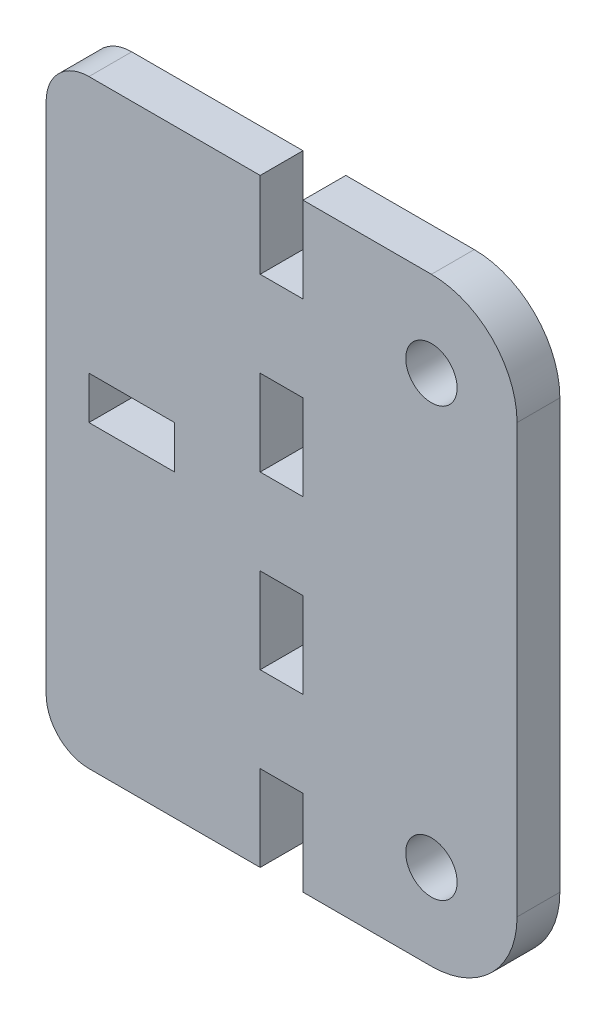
ISO-10303-21;
HEADER;
FILE_DESCRIPTION(('STEP AP214'),'2;1');
FILE_NAME('part.step','',(''),(''),'','','');
FILE_SCHEMA(('AUTOMOTIVE_DESIGN { 1 0 10303 214 1 1 1 1 }'));
ENDSEC;
DATA;
#1=APPLICATION_CONTEXT('core data for automotive mechanical design processes');
#2=APPLICATION_PROTOCOL_DEFINITION('international standard','automotive_design',2000,#1);
#3=PRODUCT_CONTEXT('',#1,'mechanical');
#4=PRODUCT('Part','Part','',(#3));
#5=PRODUCT_RELATED_PRODUCT_CATEGORY('part','',(#4));
#6=PRODUCT_DEFINITION_FORMATION('','',#4);
#7=PRODUCT_DEFINITION_CONTEXT('part definition',#1,'design');
#8=PRODUCT_DEFINITION('design','',#6,#7);
#9=PRODUCT_DEFINITION_SHAPE('','',#8);
#10=(LENGTH_UNIT() NAMED_UNIT(*) SI_UNIT(.MILLI.,.METRE.));
#11=(NAMED_UNIT(*) PLANE_ANGLE_UNIT() SI_UNIT($,.RADIAN.));
#12=(NAMED_UNIT(*) SI_UNIT($,.STERADIAN.) SOLID_ANGLE_UNIT());
#13=UNCERTAINTY_MEASURE_WITH_UNIT(LENGTH_MEASURE(1.E-05),#10,'distance_accuracy_value','');
#14=(GEOMETRIC_REPRESENTATION_CONTEXT(3) GLOBAL_UNCERTAINTY_ASSIGNED_CONTEXT((#13)) GLOBAL_UNIT_ASSIGNED_CONTEXT((#10,
#11,#12)) REPRESENTATION_CONTEXT('',''));
#15=CARTESIAN_POINT('',(0.,0.,0.));
#16=DIRECTION('',(0.,0.,1.));
#17=DIRECTION('',(1.,0.,0.));
#18=AXIS2_PLACEMENT_3D('',#15,#16,#17);
#19=CARTESIAN_POINT('',(0.,35.,5.));
#20=DIRECTION('',(0.,-1.,0.));
#21=DIRECTION('',(1.,0.,0.));
#22=AXIS2_PLACEMENT_3D('',#19,#20,#21);
#23=PLANE('',#22);
#24=DIRECTION('',(-1.,0.,0.));
#25=VECTOR('',#24,1.);
#26=CARTESIAN_POINT('',(0.,35.,0.));
#27=LINE('',#26,#25);
#28=CARTESIAN_POINT('',(-5.,35.,0.));
#29=VERTEX_POINT('',#28);
#30=CARTESIAN_POINT('',(-25.,35.,0.));
#31=VERTEX_POINT('',#30);
#32=EDGE_CURVE('E353',#29,#31,#27,.T.);
#33=ORIENTED_EDGE('',*,*,#32,.T.);
#34=DIRECTION('',(0.,0.,-1.));
#35=VECTOR('',#34,1.);
#36=CARTESIAN_POINT('',(-25.,35.,5.));
#37=LINE('',#36,#35);
#38=CARTESIAN_POINT('',(-25.,35.,5.));
#39=VERTEX_POINT('',#38);
#40=EDGE_CURVE('E56',#31,#39,#37,.F.);
#41=ORIENTED_EDGE('',*,*,#40,.T.);
#42=DIRECTION('',(-1.,0.,0.));
#43=VECTOR('',#42,1.);
#44=CARTESIAN_POINT('',(0.,35.,5.));
#45=LINE('',#44,#43);
#46=CARTESIAN_POINT('',(-5.,35.,5.));
#47=VERTEX_POINT('',#46);
#48=EDGE_CURVE('E360',#47,#39,#45,.T.);
#49=ORIENTED_EDGE('',*,*,#48,.F.);
#50=DIRECTION('',(0.,0.,1.));
#51=VECTOR('',#50,1.);
#52=CARTESIAN_POINT('',(-5.,35.,-5.));
#53=LINE('',#52,#51);
#54=EDGE_CURVE('E279',#29,#47,#53,.T.);
#55=ORIENTED_EDGE('',*,*,#54,.F.);
#56=EDGE_LOOP('',(#33,#41,#49,#55));
#57=FACE_BOUND('',#56,.T.);
#58=ADVANCED_FACE('F33',(#57),#23,.F.);
#59=CARTESIAN_POINT('',(-30.,-35.,5.));
#60=DIRECTION('',(1.,0.,0.));
#61=DIRECTION('',(0.,0.,-1.));
#62=AXIS2_PLACEMENT_3D('',#59,#60,#61);
#63=PLANE('',#62);
#64=DIRECTION('',(0.,-1.,0.));
#65=VECTOR('',#64,1.);
#66=CARTESIAN_POINT('',(-30.,-35.,5.));
#67=LINE('',#66,#65);
#68=CARTESIAN_POINT('',(-30.,30.,5.));
#69=VERTEX_POINT('',#68);
#70=CARTESIAN_POINT('',(-30.,-30.,5.));
#71=VERTEX_POINT('',#70);
#72=EDGE_CURVE('E362',#69,#71,#67,.T.);
#73=ORIENTED_EDGE('',*,*,#72,.F.);
#74=DIRECTION('',(0.,0.,-1.));
#75=VECTOR('',#74,1.);
#76=CARTESIAN_POINT('',(-30.,30.,5.));
#77=LINE('',#76,#75);
#78=CARTESIAN_POINT('',(-30.,30.,0.));
#79=VERTEX_POINT('',#78);
#80=EDGE_CURVE('E421',#69,#79,#77,.T.);
#81=ORIENTED_EDGE('',*,*,#80,.T.);
#82=DIRECTION('',(0.,-1.,0.));
#83=VECTOR('',#82,1.);
#84=CARTESIAN_POINT('',(-30.,-35.,0.));
#85=LINE('',#84,#83);
#86=CARTESIAN_POINT('',(-30.,-30.,0.));
#87=VERTEX_POINT('',#86);
#88=EDGE_CURVE('E369',#79,#87,#85,.T.);
#89=ORIENTED_EDGE('',*,*,#88,.T.);
#90=DIRECTION('',(0.,0.,-1.));
#91=VECTOR('',#90,1.);
#92=CARTESIAN_POINT('',(-30.,-30.,5.));
#93=LINE('',#92,#91);
#94=EDGE_CURVE('E419',#87,#71,#93,.F.);
#95=ORIENTED_EDGE('',*,*,#94,.T.);
#96=EDGE_LOOP('',(#73,#81,#89,#95));
#97=FACE_BOUND('',#96,.T.);
#98=ADVANCED_FACE('F435',(#97),#63,.F.);
#99=CARTESIAN_POINT('',(0.,-35.,5.));
#100=DIRECTION('',(0.,1.,0.));
#101=DIRECTION('',(-1.,0.,0.));
#102=AXIS2_PLACEMENT_3D('',#99,#100,#101);
#103=PLANE('',#102);
#104=DIRECTION('',(1.,0.,0.));
#105=VECTOR('',#104,1.);
#106=CARTESIAN_POINT('',(0.,-35.,5.));
#107=LINE('',#106,#105);
#108=CARTESIAN_POINT('',(-25.,-35.,5.));
#109=VERTEX_POINT('',#108);
#110=CARTESIAN_POINT('',(-5.,-35.,5.));
#111=VERTEX_POINT('',#110);
#112=EDGE_CURVE('E365',#109,#111,#107,.T.);
#113=ORIENTED_EDGE('',*,*,#112,.F.);
#114=DIRECTION('',(0.,0.,-1.));
#115=VECTOR('',#114,1.);
#116=CARTESIAN_POINT('',(-25.,-35.,5.));
#117=LINE('',#116,#115);
#118=CARTESIAN_POINT('',(-25.,-35.,0.));
#119=VERTEX_POINT('',#118);
#120=EDGE_CURVE('E11',#109,#119,#117,.T.);
#121=ORIENTED_EDGE('',*,*,#120,.T.);
#122=DIRECTION('',(1.,0.,0.));
#123=VECTOR('',#122,1.);
#124=CARTESIAN_POINT('',(0.,-35.,0.));
#125=LINE('',#124,#123);
#126=CARTESIAN_POINT('',(-5.,-35.,0.));
#127=VERTEX_POINT('',#126);
#128=EDGE_CURVE('E363',#119,#127,#125,.T.);
#129=ORIENTED_EDGE('',*,*,#128,.T.);
#130=DIRECTION('',(0.,0.,1.));
#131=VECTOR('',#130,1.);
#132=CARTESIAN_POINT('',(-5.,-35.,-5.));
#133=LINE('',#132,#131);
#134=EDGE_CURVE('E321',#127,#111,#133,.T.);
#135=ORIENTED_EDGE('',*,*,#134,.T.);
#136=EDGE_LOOP('',(#113,#121,#129,#135));
#137=FACE_BOUND('',#136,.T.);
#138=ADVANCED_FACE('F494',(#137),#103,.F.);
#139=CARTESIAN_POINT('',(0.,0.,5.));
#140=DIRECTION('',(0.,0.,1.));
#141=DIRECTION('',(1.,0.,0.));
#142=AXIS2_PLACEMENT_3D('',#139,#140,#141);
#143=PLANE('',#142);
#144=CARTESIAN_POINT('',(15.,-25.,5.));
#145=DIRECTION('',(0.,0.,1.));
#146=DIRECTION('',(1.,0.,0.));
#147=AXIS2_PLACEMENT_3D('',#144,#145,#146);
#148=CIRCLE('',#147,3.);
#149=CARTESIAN_POINT('',(18.,-25.,5.));
#150=VERTEX_POINT('',#149);
#151=EDGE_CURVE('E477',#150,#150,#148,.T.);
#152=ORIENTED_EDGE('',*,*,#151,.F.);
#153=EDGE_LOOP('',(#152));
#154=FACE_BOUND('',#153,.T.);
#155=CARTESIAN_POINT('',(15.,25.,5.));
#156=DIRECTION('',(0.,0.,1.));
#157=DIRECTION('',(1.,0.,0.));
#158=AXIS2_PLACEMENT_3D('',#155,#156,#157);
#159=CIRCLE('',#158,3.);
#160=CARTESIAN_POINT('',(18.,25.,5.));
#161=VERTEX_POINT('',#160);
#162=EDGE_CURVE('E471',#161,#161,#159,.T.);
#163=ORIENTED_EDGE('',*,*,#162,.F.);
#164=EDGE_LOOP('',(#163));
#165=FACE_BOUND('',#164,.T.);
#166=DIRECTION('',(0.,-1.,0.));
#167=VECTOR('',#166,1.);
#168=CARTESIAN_POINT('',(0.,35.,5.));
#169=LINE('',#168,#167);
#170=CARTESIAN_POINT('',(0.,-5.,5.));
#171=VERTEX_POINT('',#170);
#172=CARTESIAN_POINT('',(0.,-15.,5.));
#173=VERTEX_POINT('',#172);
#174=EDGE_CURVE('E244',#171,#173,#169,.T.);
#175=ORIENTED_EDGE('',*,*,#174,.T.);
#176=DIRECTION('',(1.,0.,0.));
#177=VECTOR('',#176,1.);
#178=CARTESIAN_POINT('',(0.,-15.,5.));
#179=LINE('',#178,#177);
#180=CARTESIAN_POINT('',(-5.,-15.,5.));
#181=VERTEX_POINT('',#180);
#182=EDGE_CURVE('E293',#181,#173,#179,.T.);
#183=ORIENTED_EDGE('',*,*,#182,.F.);
#184=DIRECTION('',(0.,-1.,0.));
#185=VECTOR('',#184,1.);
#186=CARTESIAN_POINT('',(-5.,-15.,5.));
#187=LINE('',#186,#185);
#188=CARTESIAN_POINT('',(-5.,-5.,5.));
#189=VERTEX_POINT('',#188);
#190=EDGE_CURVE('E304',#189,#181,#187,.T.);
#191=ORIENTED_EDGE('',*,*,#190,.F.);
#192=DIRECTION('',(-1.,0.,0.));
#193=VECTOR('',#192,1.);
#194=CARTESIAN_POINT('',(0.,-5.,5.));
#195=LINE('',#194,#193);
#196=EDGE_CURVE('E301',#171,#189,#195,.T.);
#197=ORIENTED_EDGE('',*,*,#196,.F.);
#198=EDGE_LOOP('',(#175,#183,#191,#197));
#199=FACE_BOUND('',#198,.T.);
#200=CARTESIAN_POINT('',(0.,15.,5.));
#201=VERTEX_POINT('',#200);
#202=CARTESIAN_POINT('',(0.,5.,5.));
#203=VERTEX_POINT('',#202);
#204=EDGE_CURVE('E257',#201,#203,#169,.T.);
#205=ORIENTED_EDGE('',*,*,#204,.T.);
#206=DIRECTION('',(1.,0.,0.));
#207=VECTOR('',#206,1.);
#208=CARTESIAN_POINT('',(0.,5.,5.));
#209=LINE('',#208,#207);
#210=CARTESIAN_POINT('',(-5.,5.,5.));
#211=VERTEX_POINT('',#210);
#212=EDGE_CURVE('E278',#211,#203,#209,.T.);
#213=ORIENTED_EDGE('',*,*,#212,.F.);
#214=DIRECTION('',(0.,-1.,0.));
#215=VECTOR('',#214,1.);
#216=CARTESIAN_POINT('',(-5.,5.,5.));
#217=LINE('',#216,#215);
#218=CARTESIAN_POINT('',(-5.,15.,5.));
#219=VERTEX_POINT('',#218);
#220=EDGE_CURVE('E287',#219,#211,#217,.T.);
#221=ORIENTED_EDGE('',*,*,#220,.F.);
#222=DIRECTION('',(-1.,0.,0.));
#223=VECTOR('',#222,1.);
#224=CARTESIAN_POINT('',(0.,15.,5.));
#225=LINE('',#224,#223);
#226=EDGE_CURVE('E284',#201,#219,#225,.T.);
#227=ORIENTED_EDGE('',*,*,#226,.F.);
#228=EDGE_LOOP('',(#205,#213,#221,#227));
#229=FACE_BOUND('',#228,.T.);
#230=ORIENTED_EDGE('',*,*,#48,.T.);
#231=CARTESIAN_POINT('',(-25.,30.,5.));
#232=DIRECTION('',(0.,0.,1.));
#233=DIRECTION('',(1.,0.,0.));
#234=AXIS2_PLACEMENT_3D('',#231,#232,#233);
#235=CIRCLE('',#234,5.);
#236=EDGE_CURVE('E41',#39,#69,#235,.T.);
#237=ORIENTED_EDGE('',*,*,#236,.T.);
#238=ORIENTED_EDGE('',*,*,#72,.T.);
#239=CARTESIAN_POINT('',(-25.,-30.,5.));
#240=DIRECTION('',(0.,0.,1.));
#241=DIRECTION('',(1.,0.,0.));
#242=AXIS2_PLACEMENT_3D('',#239,#240,#241);
#243=CIRCLE('',#242,5.);
#244=EDGE_CURVE('E48',#71,#109,#243,.T.);
#245=ORIENTED_EDGE('',*,*,#244,.T.);
#246=ORIENTED_EDGE('',*,*,#112,.T.);
#247=DIRECTION('',(0.,-1.,0.));
#248=VECTOR('',#247,1.);
#249=CARTESIAN_POINT('',(-5.,-35.,5.));
#250=LINE('',#249,#248);
#251=CARTESIAN_POINT('',(-5.,-25.,5.));
#252=VERTEX_POINT('',#251);
#253=EDGE_CURVE('E317',#252,#111,#250,.T.);
#254=ORIENTED_EDGE('',*,*,#253,.F.);
#255=DIRECTION('',(-1.,0.,0.));
#256=VECTOR('',#255,1.);
#257=CARTESIAN_POINT('',(0.,-25.,5.));
#258=LINE('',#257,#256);
#259=CARTESIAN_POINT('',(0.,-25.,5.));
#260=VERTEX_POINT('',#259);
#261=EDGE_CURVE('E241',#260,#252,#258,.T.);
#262=ORIENTED_EDGE('',*,*,#261,.F.);
#263=CARTESIAN_POINT('',(0.,-35.,5.));
#264=VERTEX_POINT('',#263);
#265=EDGE_CURVE('E236',#260,#264,#169,.T.);
#266=ORIENTED_EDGE('',*,*,#265,.T.);
#267=DIRECTION('',(-1.,0.,0.));
#268=VECTOR('',#267,1.);
#269=CARTESIAN_POINT('',(25.,-35.,5.));
#270=LINE('',#269,#268);
#271=CARTESIAN_POINT('',(15.,-35.,5.));
#272=VERTEX_POINT('',#271);
#273=EDGE_CURVE('E221',#272,#264,#270,.T.);
#274=ORIENTED_EDGE('',*,*,#273,.F.);
#275=CARTESIAN_POINT('',(15.,-25.,5.));
#276=DIRECTION('',(0.,0.,1.));
#277=DIRECTION('',(1.,0.,0.));
#278=AXIS2_PLACEMENT_3D('',#275,#276,#277);
#279=CIRCLE('',#278,10.);
#280=CARTESIAN_POINT('',(25.,-25.,5.));
#281=VERTEX_POINT('',#280);
#282=EDGE_CURVE('E408',#272,#281,#279,.T.);
#283=ORIENTED_EDGE('',*,*,#282,.T.);
#284=DIRECTION('',(0.,-1.,0.));
#285=VECTOR('',#284,1.);
#286=CARTESIAN_POINT('',(25.,35.,5.));
#287=LINE('',#286,#285);
#288=CARTESIAN_POINT('',(25.,25.,5.));
#289=VERTEX_POINT('',#288);
#290=EDGE_CURVE('E264',#289,#281,#287,.T.);
#291=ORIENTED_EDGE('',*,*,#290,.F.);
#292=CARTESIAN_POINT('',(15.,25.,5.));
#293=DIRECTION('',(0.,0.,1.));
#294=DIRECTION('',(1.,0.,0.));
#295=AXIS2_PLACEMENT_3D('',#292,#293,#294);
#296=CIRCLE('',#295,10.);
#297=CARTESIAN_POINT('',(15.,35.,5.));
#298=VERTEX_POINT('',#297);
#299=EDGE_CURVE('E410',#289,#298,#296,.T.);
#300=ORIENTED_EDGE('',*,*,#299,.T.);
#301=DIRECTION('',(-1.,0.,0.));
#302=VECTOR('',#301,1.);
#303=CARTESIAN_POINT('',(25.,35.,5.));
#304=LINE('',#303,#302);
#305=CARTESIAN_POINT('',(0.,35.,5.));
#306=VERTEX_POINT('',#305);
#307=EDGE_CURVE('E265',#298,#306,#304,.T.);
#308=ORIENTED_EDGE('',*,*,#307,.T.);
#309=CARTESIAN_POINT('',(0.,25.,5.));
#310=VERTEX_POINT('',#309);
#311=EDGE_CURVE('E247',#306,#310,#169,.T.);
#312=ORIENTED_EDGE('',*,*,#311,.T.);
#313=DIRECTION('',(1.,0.,0.));
#314=VECTOR('',#313,1.);
#315=CARTESIAN_POINT('',(0.,25.,5.));
#316=LINE('',#315,#314);
#317=CARTESIAN_POINT('',(-5.,25.,5.));
#318=VERTEX_POINT('',#317);
#319=EDGE_CURVE('E231',#318,#310,#316,.T.);
#320=ORIENTED_EDGE('',*,*,#319,.F.);
#321=DIRECTION('',(0.,-1.,0.));
#322=VECTOR('',#321,1.);
#323=CARTESIAN_POINT('',(-5.,25.,5.));
#324=LINE('',#323,#322);
#325=EDGE_CURVE('E272',#47,#318,#324,.T.);
#326=ORIENTED_EDGE('',*,*,#325,.F.);
#327=EDGE_LOOP('',(#230,#237,#238,#245,#246,#254,#262,#266,#274,#283,#291,#300,#308,#312,#320,#326));
#328=FACE_BOUND('',#327,.T.);
#329=DIRECTION('',(0.,1.,0.));
#330=VECTOR('',#329,1.);
#331=CARTESIAN_POINT('',(-15.,0.,5.));
#332=LINE('',#331,#330);
#333=CARTESIAN_POINT('',(-15.,0.,5.));
#334=VERTEX_POINT('',#333);
#335=CARTESIAN_POINT('',(-15.,5.,5.));
#336=VERTEX_POINT('',#335);
#337=EDGE_CURVE('E324',#334,#336,#332,.T.);
#338=ORIENTED_EDGE('',*,*,#337,.F.);
#339=DIRECTION('',(1.,0.,0.));
#340=VECTOR('',#339,1.);
#341=CARTESIAN_POINT('',(-15.,0.,5.));
#342=LINE('',#341,#340);
#343=CARTESIAN_POINT('',(-25.,0.,5.));
#344=VERTEX_POINT('',#343);
#345=EDGE_CURVE('E332',#344,#334,#342,.T.);
#346=ORIENTED_EDGE('',*,*,#345,.F.);
#347=DIRECTION('',(0.,-1.,0.));
#348=VECTOR('',#347,1.);
#349=CARTESIAN_POINT('',(-25.,0.,5.));
#350=LINE('',#349,#348);
#351=CARTESIAN_POINT('',(-25.,5.,5.));
#352=VERTEX_POINT('',#351);
#353=EDGE_CURVE('E346',#352,#344,#350,.T.);
#354=ORIENTED_EDGE('',*,*,#353,.F.);
#355=DIRECTION('',(-1.,0.,0.));
#356=VECTOR('',#355,1.);
#357=CARTESIAN_POINT('',(-15.,5.,5.));
#358=LINE('',#357,#356);
#359=EDGE_CURVE('E343',#336,#352,#358,.T.);
#360=ORIENTED_EDGE('',*,*,#359,.F.);
#361=EDGE_LOOP('',(#338,#346,#354,#360));
#362=FACE_BOUND('',#361,.T.);
#363=ADVANCED_FACE('F237',(#154,#165,#199,#229,#328,#362),#143,.T.);
#364=CARTESIAN_POINT('',(0.,0.,0.));
#365=DIRECTION('',(0.,0.,1.));
#366=DIRECTION('',(1.,0.,0.));
#367=AXIS2_PLACEMENT_3D('',#364,#365,#366);
#368=PLANE('',#367);
#369=CARTESIAN_POINT('',(15.,-25.,0.));
#370=DIRECTION('',(0.,0.,1.));
#371=DIRECTION('',(1.,0.,0.));
#372=AXIS2_PLACEMENT_3D('',#369,#370,#371);
#373=CIRCLE('',#372,3.);
#374=CARTESIAN_POINT('',(18.,-25.,0.));
#375=VERTEX_POINT('',#374);
#376=EDGE_CURVE('E474',#375,#375,#373,.T.);
#377=ORIENTED_EDGE('',*,*,#376,.T.);
#378=EDGE_LOOP('',(#377));
#379=FACE_BOUND('',#378,.T.);
#380=CARTESIAN_POINT('',(15.,25.,0.));
#381=DIRECTION('',(0.,0.,1.));
#382=DIRECTION('',(1.,0.,0.));
#383=AXIS2_PLACEMENT_3D('',#380,#381,#382);
#384=CIRCLE('',#383,3.);
#385=CARTESIAN_POINT('',(18.,25.,0.));
#386=VERTEX_POINT('',#385);
#387=EDGE_CURVE('E245',#386,#386,#384,.T.);
#388=ORIENTED_EDGE('',*,*,#387,.T.);
#389=EDGE_LOOP('',(#388));
#390=FACE_BOUND('',#389,.T.);
#391=DIRECTION('',(1.,0.,0.));
#392=VECTOR('',#391,1.);
#393=CARTESIAN_POINT('',(0.,-15.,0.));
#394=LINE('',#393,#392);
#395=CARTESIAN_POINT('',(-5.,-15.,0.));
#396=VERTEX_POINT('',#395);
#397=CARTESIAN_POINT('',(0.,-15.,0.));
#398=VERTEX_POINT('',#397);
#399=EDGE_CURVE('E384',#396,#398,#394,.T.);
#400=ORIENTED_EDGE('',*,*,#399,.T.);
#401=DIRECTION('',(0.,1.,0.));
#402=VECTOR('',#401,1.);
#403=CARTESIAN_POINT('',(0.,35.,0.));
#404=LINE('',#403,#402);
#405=CARTESIAN_POINT('',(0.,-5.,0.));
#406=VERTEX_POINT('',#405);
#407=EDGE_CURVE('E261',#398,#406,#404,.T.);
#408=ORIENTED_EDGE('',*,*,#407,.T.);
#409=DIRECTION('',(-1.,0.,0.));
#410=VECTOR('',#409,1.);
#411=CARTESIAN_POINT('',(0.,-5.,0.));
#412=LINE('',#411,#410);
#413=CARTESIAN_POINT('',(-5.,-5.,0.));
#414=VERTEX_POINT('',#413);
#415=EDGE_CURVE('E378',#406,#414,#412,.T.);
#416=ORIENTED_EDGE('',*,*,#415,.T.);
#417=DIRECTION('',(0.,-1.,0.));
#418=VECTOR('',#417,1.);
#419=CARTESIAN_POINT('',(-5.,0.,0.));
#420=LINE('',#419,#418);
#421=EDGE_CURVE('E381',#414,#396,#420,.T.);
#422=ORIENTED_EDGE('',*,*,#421,.T.);
#423=EDGE_LOOP('',(#400,#408,#416,#422));
#424=FACE_BOUND('',#423,.T.);
#425=DIRECTION('',(1.,0.,0.));
#426=VECTOR('',#425,1.);
#427=CARTESIAN_POINT('',(0.,5.,0.));
#428=LINE('',#427,#426);
#429=CARTESIAN_POINT('',(-5.,5.,0.));
#430=VERTEX_POINT('',#429);
#431=CARTESIAN_POINT('',(0.,5.,0.));
#432=VERTEX_POINT('',#431);
#433=EDGE_CURVE('E393',#430,#432,#428,.T.);
#434=ORIENTED_EDGE('',*,*,#433,.T.);
#435=CARTESIAN_POINT('',(0.,15.,0.));
#436=VERTEX_POINT('',#435);
#437=EDGE_CURVE('E254',#432,#436,#404,.T.);
#438=ORIENTED_EDGE('',*,*,#437,.T.);
#439=DIRECTION('',(-1.,0.,0.));
#440=VECTOR('',#439,1.);
#441=CARTESIAN_POINT('',(0.,15.,0.));
#442=LINE('',#441,#440);
#443=CARTESIAN_POINT('',(-5.,15.,0.));
#444=VERTEX_POINT('',#443);
#445=EDGE_CURVE('E387',#436,#444,#442,.T.);
#446=ORIENTED_EDGE('',*,*,#445,.T.);
#447=DIRECTION('',(0.,-1.,0.));
#448=VECTOR('',#447,1.);
#449=CARTESIAN_POINT('',(-5.,0.,0.));
#450=LINE('',#449,#448);
#451=EDGE_CURVE('E390',#444,#430,#450,.T.);
#452=ORIENTED_EDGE('',*,*,#451,.T.);
#453=EDGE_LOOP('',(#434,#438,#446,#452));
#454=FACE_BOUND('',#453,.T.);
#455=DIRECTION('',(1.,0.,0.));
#456=VECTOR('',#455,1.);
#457=CARTESIAN_POINT('',(-15.,0.,0.));
#458=LINE('',#457,#456);
#459=CARTESIAN_POINT('',(-25.,0.,0.));
#460=VERTEX_POINT('',#459);
#461=CARTESIAN_POINT('',(-15.,0.,0.));
#462=VERTEX_POINT('',#461);
#463=EDGE_CURVE('E338',#460,#462,#458,.T.);
#464=ORIENTED_EDGE('',*,*,#463,.T.);
#465=DIRECTION('',(0.,1.,0.));
#466=VECTOR('',#465,1.);
#467=CARTESIAN_POINT('',(-15.,0.,0.));
#468=LINE('',#467,#466);
#469=CARTESIAN_POINT('',(-15.,5.,0.));
#470=VERTEX_POINT('',#469);
#471=EDGE_CURVE('E328',#462,#470,#468,.T.);
#472=ORIENTED_EDGE('',*,*,#471,.T.);
#473=DIRECTION('',(-1.,0.,0.));
#474=VECTOR('',#473,1.);
#475=CARTESIAN_POINT('',(-15.,5.,0.));
#476=LINE('',#475,#474);
#477=CARTESIAN_POINT('',(-25.,5.,0.));
#478=VERTEX_POINT('',#477);
#479=EDGE_CURVE('E331',#470,#478,#476,.T.);
#480=ORIENTED_EDGE('',*,*,#479,.T.);
#481=DIRECTION('',(0.,-1.,0.));
#482=VECTOR('',#481,1.);
#483=CARTESIAN_POINT('',(-25.,0.,0.));
#484=LINE('',#483,#482);
#485=EDGE_CURVE('E335',#478,#460,#484,.T.);
#486=ORIENTED_EDGE('',*,*,#485,.T.);
#487=EDGE_LOOP('',(#464,#472,#480,#486));
#488=FACE_BOUND('',#487,.T.);
#489=ORIENTED_EDGE('',*,*,#88,.F.);
#490=CARTESIAN_POINT('',(-25.,30.,0.));
#491=DIRECTION('',(0.,0.,1.));
#492=DIRECTION('',(1.,0.,0.));
#493=AXIS2_PLACEMENT_3D('',#490,#491,#492);
#494=CIRCLE('',#493,5.);
#495=EDGE_CURVE('E426',#79,#31,#494,.F.);
#496=ORIENTED_EDGE('',*,*,#495,.T.);
#497=ORIENTED_EDGE('',*,*,#32,.F.);
#498=DIRECTION('',(0.,-1.,0.));
#499=VECTOR('',#498,1.);
#500=CARTESIAN_POINT('',(-5.,0.,0.));
#501=LINE('',#500,#499);
#502=CARTESIAN_POINT('',(-5.,25.,0.));
#503=VERTEX_POINT('',#502);
#504=EDGE_CURVE('E396',#29,#503,#501,.T.);
#505=ORIENTED_EDGE('',*,*,#504,.T.);
#506=DIRECTION('',(1.,0.,0.));
#507=VECTOR('',#506,1.);
#508=CARTESIAN_POINT('',(0.,25.,0.));
#509=LINE('',#508,#507);
#510=CARTESIAN_POINT('',(0.,25.,0.));
#511=VERTEX_POINT('',#510);
#512=EDGE_CURVE('E399',#503,#511,#509,.T.);
#513=ORIENTED_EDGE('',*,*,#512,.T.);
#514=CARTESIAN_POINT('',(0.,35.,0.));
#515=VERTEX_POINT('',#514);
#516=EDGE_CURVE('E251',#511,#515,#404,.T.);
#517=ORIENTED_EDGE('',*,*,#516,.T.);
#518=DIRECTION('',(-1.,0.,0.));
#519=VECTOR('',#518,1.);
#520=CARTESIAN_POINT('',(25.,35.,0.));
#521=LINE('',#520,#519);
#522=CARTESIAN_POINT('',(15.,35.,0.));
#523=VERTEX_POINT('',#522);
#524=EDGE_CURVE('E267',#523,#515,#521,.T.);
#525=ORIENTED_EDGE('',*,*,#524,.F.);
#526=CARTESIAN_POINT('',(15.,25.,0.));
#527=DIRECTION('',(0.,0.,1.));
#528=DIRECTION('',(1.,0.,0.));
#529=AXIS2_PLACEMENT_3D('',#526,#527,#528);
#530=CIRCLE('',#529,10.);
#531=CARTESIAN_POINT('',(25.,25.,0.));
#532=VERTEX_POINT('',#531);
#533=EDGE_CURVE('E416',#523,#532,#530,.F.);
#534=ORIENTED_EDGE('',*,*,#533,.T.);
#535=DIRECTION('',(0.,1.,0.));
#536=VECTOR('',#535,1.);
#537=CARTESIAN_POINT('',(25.,35.,0.));
#538=LINE('',#537,#536);
#539=CARTESIAN_POINT('',(25.,-25.,0.));
#540=VERTEX_POINT('',#539);
#541=EDGE_CURVE('E268',#540,#532,#538,.T.);
#542=ORIENTED_EDGE('',*,*,#541,.F.);
#543=CARTESIAN_POINT('',(15.,-25.,0.));
#544=DIRECTION('',(0.,0.,1.));
#545=DIRECTION('',(1.,0.,0.));
#546=AXIS2_PLACEMENT_3D('',#543,#544,#545);
#547=CIRCLE('',#546,10.);
#548=CARTESIAN_POINT('',(15.,-35.,0.));
#549=VERTEX_POINT('',#548);
#550=EDGE_CURVE('E414',#540,#549,#547,.F.);
#551=ORIENTED_EDGE('',*,*,#550,.T.);
#552=DIRECTION('',(-1.,0.,0.));
#553=VECTOR('',#552,1.);
#554=CARTESIAN_POINT('',(25.,-35.,0.));
#555=LINE('',#554,#553);
#556=CARTESIAN_POINT('',(0.,-35.,0.));
#557=VERTEX_POINT('',#556);
#558=EDGE_CURVE('E232',#549,#557,#555,.T.);
#559=ORIENTED_EDGE('',*,*,#558,.T.);
#560=CARTESIAN_POINT('',(0.,-25.,0.));
#561=VERTEX_POINT('',#560);
#562=EDGE_CURVE('E250',#557,#561,#404,.T.);
#563=ORIENTED_EDGE('',*,*,#562,.T.);
#564=DIRECTION('',(-1.,0.,0.));
#565=VECTOR('',#564,1.);
#566=CARTESIAN_POINT('',(0.,-25.,0.));
#567=LINE('',#566,#565);
#568=CARTESIAN_POINT('',(-5.,-25.,0.));
#569=VERTEX_POINT('',#568);
#570=EDGE_CURVE('E367',#561,#569,#567,.T.);
#571=ORIENTED_EDGE('',*,*,#570,.T.);
#572=DIRECTION('',(0.,-1.,0.));
#573=VECTOR('',#572,1.);
#574=CARTESIAN_POINT('',(-5.,0.,0.));
#575=LINE('',#574,#573);
#576=EDGE_CURVE('E375',#569,#127,#575,.T.);
#577=ORIENTED_EDGE('',*,*,#576,.T.);
#578=ORIENTED_EDGE('',*,*,#128,.F.);
#579=CARTESIAN_POINT('',(-25.,-30.,0.));
#580=DIRECTION('',(0.,0.,1.));
#581=DIRECTION('',(1.,0.,0.));
#582=AXIS2_PLACEMENT_3D('',#579,#580,#581);
#583=CIRCLE('',#582,5.);
#584=EDGE_CURVE('E424',#119,#87,#583,.F.);
#585=ORIENTED_EDGE('',*,*,#584,.T.);
#586=EDGE_LOOP('',(#489,#496,#497,#505,#513,#517,#525,#534,#542,#551,#559,#563,#571,#577,#578,#585));
#587=FACE_BOUND('',#586,.T.);
#588=ADVANCED_FACE('F441',(#379,#390,#424,#454,#488,#587),#368,.F.);
#589=CARTESIAN_POINT('',(-15.,0.,0.));
#590=DIRECTION('',(1.,0.,0.));
#591=DIRECTION('',(0.,0.,-1.));
#592=AXIS2_PLACEMENT_3D('',#589,#590,#591);
#593=PLANE('',#592);
#594=ORIENTED_EDGE('',*,*,#337,.T.);
#595=DIRECTION('',(0.,0.,1.));
#596=VECTOR('',#595,1.);
#597=CARTESIAN_POINT('',(-15.,5.,0.));
#598=LINE('',#597,#596);
#599=EDGE_CURVE('E341',#470,#336,#598,.T.);
#600=ORIENTED_EDGE('',*,*,#599,.F.);
#601=ORIENTED_EDGE('',*,*,#471,.F.);
#602=DIRECTION('',(0.,0.,1.));
#603=VECTOR('',#602,1.);
#604=CARTESIAN_POINT('',(-15.,0.,0.));
#605=LINE('',#604,#603);
#606=EDGE_CURVE('E351',#462,#334,#605,.T.);
#607=ORIENTED_EDGE('',*,*,#606,.T.);
#608=EDGE_LOOP('',(#594,#600,#601,#607));
#609=FACE_BOUND('',#608,.T.);
#610=ADVANCED_FACE('F578',(#609),#593,.F.);
#611=CARTESIAN_POINT('',(-15.,0.,0.));
#612=DIRECTION('',(0.,-1.,0.));
#613=DIRECTION('',(0.,0.,-1.));
#614=AXIS2_PLACEMENT_3D('',#611,#612,#613);
#615=PLANE('',#614);
#616=ORIENTED_EDGE('',*,*,#345,.T.);
#617=ORIENTED_EDGE('',*,*,#606,.F.);
#618=ORIENTED_EDGE('',*,*,#463,.F.);
#619=DIRECTION('',(0.,0.,1.));
#620=VECTOR('',#619,1.);
#621=CARTESIAN_POINT('',(-25.,0.,0.));
#622=LINE('',#621,#620);
#623=EDGE_CURVE('E354',#460,#344,#622,.T.);
#624=ORIENTED_EDGE('',*,*,#623,.T.);
#625=EDGE_LOOP('',(#616,#617,#618,#624));
#626=FACE_BOUND('',#625,.T.);
#627=ADVANCED_FACE('F574',(#626),#615,.F.);
#628=CARTESIAN_POINT('',(-25.,0.,0.));
#629=DIRECTION('',(-1.,0.,0.));
#630=DIRECTION('',(0.,0.,1.));
#631=AXIS2_PLACEMENT_3D('',#628,#629,#630);
#632=PLANE('',#631);
#633=ORIENTED_EDGE('',*,*,#353,.T.);
#634=ORIENTED_EDGE('',*,*,#623,.F.);
#635=ORIENTED_EDGE('',*,*,#485,.F.);
#636=DIRECTION('',(0.,0.,1.));
#637=VECTOR('',#636,1.);
#638=CARTESIAN_POINT('',(-25.,5.,0.));
#639=LINE('',#638,#637);
#640=EDGE_CURVE('E356',#478,#352,#639,.T.);
#641=ORIENTED_EDGE('',*,*,#640,.T.);
#642=EDGE_LOOP('',(#633,#634,#635,#641));
#643=FACE_BOUND('',#642,.T.);
#644=ADVANCED_FACE('F577',(#643),#632,.F.);
#645=CARTESIAN_POINT('',(-15.,5.,0.));
#646=DIRECTION('',(0.,1.,0.));
#647=DIRECTION('',(-1.,0.,0.));
#648=AXIS2_PLACEMENT_3D('',#645,#646,#647);
#649=PLANE('',#648);
#650=ORIENTED_EDGE('',*,*,#359,.T.);
#651=ORIENTED_EDGE('',*,*,#640,.F.);
#652=ORIENTED_EDGE('',*,*,#479,.F.);
#653=ORIENTED_EDGE('',*,*,#599,.T.);
#654=EDGE_LOOP('',(#650,#651,#652,#653));
#655=FACE_BOUND('',#654,.T.);
#656=ADVANCED_FACE('F571',(#655),#649,.F.);
#657=CARTESIAN_POINT('',(-5.,-35.,-5.));
#658=DIRECTION('',(-1.,0.,0.));
#659=DIRECTION('',(0.,-1.,0.));
#660=AXIS2_PLACEMENT_3D('',#657,#658,#659);
#661=PLANE('',#660);
#662=DIRECTION('',(0.,0.,1.));
#663=VECTOR('',#662,1.);
#664=CARTESIAN_POINT('',(-5.,-25.,-5.));
#665=LINE('',#664,#663);
#666=EDGE_CURVE('E325',#569,#252,#665,.T.);
#667=ORIENTED_EDGE('',*,*,#666,.T.);
#668=ORIENTED_EDGE('',*,*,#253,.T.);
#669=ORIENTED_EDGE('',*,*,#134,.F.);
#670=ORIENTED_EDGE('',*,*,#576,.F.);
#671=EDGE_LOOP('',(#667,#668,#669,#670));
#672=FACE_BOUND('',#671,.T.);
#673=ADVANCED_FACE('F558',(#672),#661,.F.);
#674=CARTESIAN_POINT('',(0.,-25.,-5.));
#675=DIRECTION('',(0.,1.,0.));
#676=DIRECTION('',(0.,0.,1.));
#677=AXIS2_PLACEMENT_3D('',#674,#675,#676);
#678=PLANE('',#677);
#679=DIRECTION('',(0.,0.,1.));
#680=VECTOR('',#679,1.);
#681=CARTESIAN_POINT('',(0.,-25.,-5.));
#682=LINE('',#681,#680);
#683=EDGE_CURVE('E320',#561,#260,#682,.T.);
#684=ORIENTED_EDGE('',*,*,#683,.T.);
#685=ORIENTED_EDGE('',*,*,#261,.T.);
#686=ORIENTED_EDGE('',*,*,#666,.F.);
#687=ORIENTED_EDGE('',*,*,#570,.F.);
#688=EDGE_LOOP('',(#684,#685,#686,#687));
#689=FACE_BOUND('',#688,.T.);
#690=ADVANCED_FACE('F560',(#689),#678,.F.);
#691=CARTESIAN_POINT('',(0.,-15.,-5.));
#692=DIRECTION('',(0.,-1.,0.));
#693=DIRECTION('',(0.,0.,-1.));
#694=AXIS2_PLACEMENT_3D('',#691,#692,#693);
#695=PLANE('',#694);
#696=DIRECTION('',(0.,0.,1.));
#697=VECTOR('',#696,1.);
#698=CARTESIAN_POINT('',(-5.,-15.,-5.));
#699=LINE('',#698,#697);
#700=EDGE_CURVE('E308',#396,#181,#699,.T.);
#701=ORIENTED_EDGE('',*,*,#700,.T.);
#702=ORIENTED_EDGE('',*,*,#182,.T.);
#703=DIRECTION('',(0.,0.,1.));
#704=VECTOR('',#703,1.);
#705=CARTESIAN_POINT('',(0.,-15.,-5.));
#706=LINE('',#705,#704);
#707=EDGE_CURVE('E307',#398,#173,#706,.T.);
#708=ORIENTED_EDGE('',*,*,#707,.F.);
#709=ORIENTED_EDGE('',*,*,#399,.F.);
#710=EDGE_LOOP('',(#701,#702,#708,#709));
#711=FACE_BOUND('',#710,.T.);
#712=ADVANCED_FACE('F562',(#711),#695,.F.);
#713=CARTESIAN_POINT('',(-5.,-15.,-5.));
#714=DIRECTION('',(-1.,0.,0.));
#715=DIRECTION('',(0.,-1.,0.));
#716=AXIS2_PLACEMENT_3D('',#713,#714,#715);
#717=PLANE('',#716);
#718=DIRECTION('',(0.,0.,1.));
#719=VECTOR('',#718,1.);
#720=CARTESIAN_POINT('',(-5.,-5.,-5.));
#721=LINE('',#720,#719);
#722=EDGE_CURVE('E310',#414,#189,#721,.T.);
#723=ORIENTED_EDGE('',*,*,#722,.T.);
#724=ORIENTED_EDGE('',*,*,#190,.T.);
#725=ORIENTED_EDGE('',*,*,#700,.F.);
#726=ORIENTED_EDGE('',*,*,#421,.F.);
#727=EDGE_LOOP('',(#723,#724,#725,#726));
#728=FACE_BOUND('',#727,.T.);
#729=ADVANCED_FACE('F568',(#728),#717,.F.);
#730=CARTESIAN_POINT('',(0.,-5.,-5.));
#731=DIRECTION('',(0.,1.,0.));
#732=DIRECTION('',(0.,0.,1.));
#733=AXIS2_PLACEMENT_3D('',#730,#731,#732);
#734=PLANE('',#733);
#735=DIRECTION('',(0.,0.,1.));
#736=VECTOR('',#735,1.);
#737=CARTESIAN_POINT('',(0.,-5.,-5.));
#738=LINE('',#737,#736);
#739=EDGE_CURVE('E312',#406,#171,#738,.T.);
#740=ORIENTED_EDGE('',*,*,#739,.T.);
#741=ORIENTED_EDGE('',*,*,#196,.T.);
#742=ORIENTED_EDGE('',*,*,#722,.F.);
#743=ORIENTED_EDGE('',*,*,#415,.F.);
#744=EDGE_LOOP('',(#740,#741,#742,#743));
#745=FACE_BOUND('',#744,.T.);
#746=ADVANCED_FACE('F633',(#745),#734,.F.);
#747=CARTESIAN_POINT('',(0.,5.,-5.));
#748=DIRECTION('',(0.,-1.,0.));
#749=DIRECTION('',(0.,0.,-1.));
#750=AXIS2_PLACEMENT_3D('',#747,#748,#749);
#751=PLANE('',#750);
#752=DIRECTION('',(0.,0.,1.));
#753=VECTOR('',#752,1.);
#754=CARTESIAN_POINT('',(-5.,5.,-5.));
#755=LINE('',#754,#753);
#756=EDGE_CURVE('E291',#430,#211,#755,.T.);
#757=ORIENTED_EDGE('',*,*,#756,.T.);
#758=ORIENTED_EDGE('',*,*,#212,.T.);
#759=DIRECTION('',(0.,0.,1.));
#760=VECTOR('',#759,1.);
#761=CARTESIAN_POINT('',(0.,5.,-5.));
#762=LINE('',#761,#760);
#763=EDGE_CURVE('E290',#432,#203,#762,.T.);
#764=ORIENTED_EDGE('',*,*,#763,.F.);
#765=ORIENTED_EDGE('',*,*,#433,.F.);
#766=EDGE_LOOP('',(#757,#758,#764,#765));
#767=FACE_BOUND('',#766,.T.);
#768=ADVANCED_FACE('F514',(#767),#751,.F.);
#769=CARTESIAN_POINT('',(-5.,5.,-5.));
#770=DIRECTION('',(-1.,0.,0.));
#771=DIRECTION('',(0.,-1.,0.));
#772=AXIS2_PLACEMENT_3D('',#769,#770,#771);
#773=PLANE('',#772);
#774=DIRECTION('',(0.,0.,1.));
#775=VECTOR('',#774,1.);
#776=CARTESIAN_POINT('',(-5.,15.,-5.));
#777=LINE('',#776,#775);
#778=EDGE_CURVE('E294',#444,#219,#777,.T.);
#779=ORIENTED_EDGE('',*,*,#778,.T.);
#780=ORIENTED_EDGE('',*,*,#220,.T.);
#781=ORIENTED_EDGE('',*,*,#756,.F.);
#782=ORIENTED_EDGE('',*,*,#451,.F.);
#783=EDGE_LOOP('',(#779,#780,#781,#782));
#784=FACE_BOUND('',#783,.T.);
#785=ADVANCED_FACE('F520',(#784),#773,.F.);
#786=CARTESIAN_POINT('',(0.,15.,-5.));
#787=DIRECTION('',(0.,1.,0.));
#788=DIRECTION('',(0.,0.,1.));
#789=AXIS2_PLACEMENT_3D('',#786,#787,#788);
#790=PLANE('',#789);
#791=DIRECTION('',(0.,0.,1.));
#792=VECTOR('',#791,1.);
#793=CARTESIAN_POINT('',(0.,15.,-5.));
#794=LINE('',#793,#792);
#795=EDGE_CURVE('E296',#436,#201,#794,.T.);
#796=ORIENTED_EDGE('',*,*,#795,.T.);
#797=ORIENTED_EDGE('',*,*,#226,.T.);
#798=ORIENTED_EDGE('',*,*,#778,.F.);
#799=ORIENTED_EDGE('',*,*,#445,.F.);
#800=EDGE_LOOP('',(#796,#797,#798,#799));
#801=FACE_BOUND('',#800,.T.);
#802=ADVANCED_FACE('F522',(#801),#790,.F.);
#803=CARTESIAN_POINT('',(0.,25.,-5.));
#804=DIRECTION('',(0.,-1.,0.));
#805=DIRECTION('',(0.,0.,-1.));
#806=AXIS2_PLACEMENT_3D('',#803,#804,#805);
#807=PLANE('',#806);
#808=DIRECTION('',(0.,0.,1.));
#809=VECTOR('',#808,1.);
#810=CARTESIAN_POINT('',(-5.,25.,-5.));
#811=LINE('',#810,#809);
#812=EDGE_CURVE('E276',#503,#318,#811,.T.);
#813=ORIENTED_EDGE('',*,*,#812,.T.);
#814=ORIENTED_EDGE('',*,*,#319,.T.);
#815=DIRECTION('',(0.,0.,1.));
#816=VECTOR('',#815,1.);
#817=CARTESIAN_POINT('',(0.,25.,-5.));
#818=LINE('',#817,#816);
#819=EDGE_CURVE('E275',#511,#310,#818,.T.);
#820=ORIENTED_EDGE('',*,*,#819,.F.);
#821=ORIENTED_EDGE('',*,*,#512,.F.);
#822=EDGE_LOOP('',(#813,#814,#820,#821));
#823=FACE_BOUND('',#822,.T.);
#824=ADVANCED_FACE('F448',(#823),#807,.F.);
#825=CARTESIAN_POINT('',(-5.,25.,-5.));
#826=DIRECTION('',(-1.,0.,0.));
#827=DIRECTION('',(0.,-1.,0.));
#828=AXIS2_PLACEMENT_3D('',#825,#826,#827);
#829=PLANE('',#828);
#830=ORIENTED_EDGE('',*,*,#54,.T.);
#831=ORIENTED_EDGE('',*,*,#325,.T.);
#832=ORIENTED_EDGE('',*,*,#812,.F.);
#833=ORIENTED_EDGE('',*,*,#504,.F.);
#834=EDGE_LOOP('',(#830,#831,#832,#833));
#835=FACE_BOUND('',#834,.T.);
#836=ADVANCED_FACE('F444',(#835),#829,.F.);
#837=CARTESIAN_POINT('',(0.,0.,0.));
#838=DIRECTION('',(1.,0.,0.));
#839=DIRECTION('',(0.,0.,-1.));
#840=AXIS2_PLACEMENT_3D('',#837,#838,#839);
#841=PLANE('',#840);
#842=ORIENTED_EDGE('',*,*,#265,.F.);
#843=ORIENTED_EDGE('',*,*,#683,.F.);
#844=ORIENTED_EDGE('',*,*,#562,.F.);
#845=DIRECTION('',(0.,0.,-1.));
#846=VECTOR('',#845,1.);
#847=CARTESIAN_POINT('',(0.,-35.,5.));
#848=LINE('',#847,#846);
#849=EDGE_CURVE('E226',#264,#557,#848,.T.);
#850=ORIENTED_EDGE('',*,*,#849,.F.);
#851=EDGE_LOOP('',(#842,#843,#844,#850));
#852=FACE_BOUND('',#851,.T.);
#853=ADVANCED_FACE('F248',(#852),#841,.F.);
#854=ORIENTED_EDGE('',*,*,#407,.F.);
#855=ORIENTED_EDGE('',*,*,#707,.T.);
#856=ORIENTED_EDGE('',*,*,#174,.F.);
#857=ORIENTED_EDGE('',*,*,#739,.F.);
#858=EDGE_LOOP('',(#854,#855,#856,#857));
#859=FACE_BOUND('',#858,.T.);
#860=ADVANCED_FACE('F692',(#859),#841,.F.);
#861=ORIENTED_EDGE('',*,*,#437,.F.);
#862=ORIENTED_EDGE('',*,*,#763,.T.);
#863=ORIENTED_EDGE('',*,*,#204,.F.);
#864=ORIENTED_EDGE('',*,*,#795,.F.);
#865=EDGE_LOOP('',(#861,#862,#863,#864));
#866=FACE_BOUND('',#865,.T.);
#867=ADVANCED_FACE('F511',(#866),#841,.F.);
#868=ORIENTED_EDGE('',*,*,#516,.F.);
#869=ORIENTED_EDGE('',*,*,#819,.T.);
#870=ORIENTED_EDGE('',*,*,#311,.F.);
#871=DIRECTION('',(0.,0.,1.));
#872=VECTOR('',#871,1.);
#873=CARTESIAN_POINT('',(0.,35.,5.));
#874=LINE('',#873,#872);
#875=EDGE_CURVE('E260',#515,#306,#874,.T.);
#876=ORIENTED_EDGE('',*,*,#875,.F.);
#877=EDGE_LOOP('',(#868,#869,#870,#876));
#878=FACE_BOUND('',#877,.T.);
#879=ADVANCED_FACE('F452',(#878),#841,.F.);
#880=CARTESIAN_POINT('',(25.,-35.,5.));
#881=DIRECTION('',(0.,1.,0.));
#882=DIRECTION('',(0.,0.,1.));
#883=AXIS2_PLACEMENT_3D('',#880,#881,#882);
#884=PLANE('',#883);
#885=ORIENTED_EDGE('',*,*,#558,.F.);
#886=DIRECTION('',(0.,0.,-1.));
#887=VECTOR('',#886,1.);
#888=CARTESIAN_POINT('',(15.,-35.,5.));
#889=LINE('',#888,#887);
#890=EDGE_CURVE('E229',#549,#272,#889,.F.);
#891=ORIENTED_EDGE('',*,*,#890,.T.);
#892=ORIENTED_EDGE('',*,*,#273,.T.);
#893=ORIENTED_EDGE('',*,*,#849,.T.);
#894=EDGE_LOOP('',(#885,#891,#892,#893));
#895=FACE_BOUND('',#894,.T.);
#896=ADVANCED_FACE('F224',(#895),#884,.F.);
#897=CARTESIAN_POINT('',(25.,35.,5.));
#898=DIRECTION('',(0.,-1.,0.));
#899=DIRECTION('',(0.,0.,-1.));
#900=AXIS2_PLACEMENT_3D('',#897,#898,#899);
#901=PLANE('',#900);
#902=ORIENTED_EDGE('',*,*,#307,.F.);
#903=DIRECTION('',(0.,0.,1.));
#904=VECTOR('',#903,1.);
#905=CARTESIAN_POINT('',(15.,35.,0.));
#906=LINE('',#905,#904);
#907=EDGE_CURVE('E412',#298,#523,#906,.F.);
#908=ORIENTED_EDGE('',*,*,#907,.T.);
#909=ORIENTED_EDGE('',*,*,#524,.T.);
#910=ORIENTED_EDGE('',*,*,#875,.T.);
#911=EDGE_LOOP('',(#902,#908,#909,#910));
#912=FACE_BOUND('',#911,.T.);
#913=ADVANCED_FACE('F741',(#912),#901,.F.);
#914=CARTESIAN_POINT('',(25.,0.,0.));
#915=DIRECTION('',(1.,0.,0.));
#916=DIRECTION('',(0.,0.,-1.));
#917=AXIS2_PLACEMENT_3D('',#914,#915,#916);
#918=PLANE('',#917);
#919=ORIENTED_EDGE('',*,*,#541,.T.);
#920=DIRECTION('',(0.,0.,1.));
#921=VECTOR('',#920,1.);
#922=CARTESIAN_POINT('',(25.,25.,5.));
#923=LINE('',#922,#921);
#924=EDGE_CURVE('E405',#532,#289,#923,.T.);
#925=ORIENTED_EDGE('',*,*,#924,.T.);
#926=ORIENTED_EDGE('',*,*,#290,.T.);
#927=DIRECTION('',(0.,0.,-1.));
#928=VECTOR('',#927,1.);
#929=CARTESIAN_POINT('',(25.,-25.,0.));
#930=LINE('',#929,#928);
#931=EDGE_CURVE('E402',#281,#540,#930,.T.);
#932=ORIENTED_EDGE('',*,*,#931,.T.);
#933=EDGE_LOOP('',(#919,#925,#926,#932));
#934=FACE_BOUND('',#933,.T.);
#935=ADVANCED_FACE('F466',(#934),#918,.T.);
#936=CARTESIAN_POINT('',(15.,25.,0.));
#937=DIRECTION('',(0.,0.,1.));
#938=DIRECTION('',(1.,0.,0.));
#939=AXIS2_PLACEMENT_3D('',#936,#937,#938);
#940=CYLINDRICAL_SURFACE('',#939,3.);
#941=ORIENTED_EDGE('',*,*,#387,.F.);
#942=EDGE_LOOP('',(#941));
#943=FACE_BOUND('',#942,.T.);
#944=ORIENTED_EDGE('',*,*,#162,.T.);
#945=EDGE_LOOP('',(#944));
#946=FACE_BOUND('',#945,.T.);
#947=ADVANCED_FACE('F488',(#943,#946),#940,.F.);
#948=CARTESIAN_POINT('',(15.,-25.,0.));
#949=DIRECTION('',(0.,0.,1.));
#950=DIRECTION('',(1.,0.,0.));
#951=AXIS2_PLACEMENT_3D('',#948,#949,#950);
#952=CYLINDRICAL_SURFACE('',#951,3.);
#953=ORIENTED_EDGE('',*,*,#376,.F.);
#954=EDGE_LOOP('',(#953));
#955=FACE_BOUND('',#954,.T.);
#956=ORIENTED_EDGE('',*,*,#151,.T.);
#957=EDGE_LOOP('',(#956));
#958=FACE_BOUND('',#957,.T.);
#959=ADVANCED_FACE('F485',(#955,#958),#952,.F.);
#960=CARTESIAN_POINT('',(15.,25.,0.));
#961=DIRECTION('',(0.,0.,-1.));
#962=DIRECTION('',(-1.,0.,0.));
#963=AXIS2_PLACEMENT_3D('',#960,#961,#962);
#964=CYLINDRICAL_SURFACE('',#963,10.);
#965=ORIENTED_EDGE('',*,*,#533,.F.);
#966=ORIENTED_EDGE('',*,*,#907,.F.);
#967=ORIENTED_EDGE('',*,*,#299,.F.);
#968=ORIENTED_EDGE('',*,*,#924,.F.);
#969=EDGE_LOOP('',(#965,#966,#967,#968));
#970=FACE_BOUND('',#969,.T.);
#971=ADVANCED_FACE('F462',(#970),#964,.T.);
#972=CARTESIAN_POINT('',(15.,-25.,0.));
#973=DIRECTION('',(0.,0.,1.));
#974=DIRECTION('',(1.,0.,0.));
#975=AXIS2_PLACEMENT_3D('',#972,#973,#974);
#976=CYLINDRICAL_SURFACE('',#975,10.);
#977=ORIENTED_EDGE('',*,*,#282,.F.);
#978=ORIENTED_EDGE('',*,*,#890,.F.);
#979=ORIENTED_EDGE('',*,*,#550,.F.);
#980=ORIENTED_EDGE('',*,*,#931,.F.);
#981=EDGE_LOOP('',(#977,#978,#979,#980));
#982=FACE_BOUND('',#981,.T.);
#983=ADVANCED_FACE('F542',(#982),#976,.T.);
#984=CARTESIAN_POINT('',(-25.,30.,5.));
#985=DIRECTION('',(0.,0.,-1.));
#986=DIRECTION('',(-1.,0.,0.));
#987=AXIS2_PLACEMENT_3D('',#984,#985,#986);
#988=CYLINDRICAL_SURFACE('',#987,5.);
#989=ORIENTED_EDGE('',*,*,#236,.F.);
#990=ORIENTED_EDGE('',*,*,#40,.F.);
#991=ORIENTED_EDGE('',*,*,#495,.F.);
#992=ORIENTED_EDGE('',*,*,#80,.F.);
#993=EDGE_LOOP('',(#989,#990,#991,#992));
#994=FACE_BOUND('',#993,.T.);
#995=ADVANCED_FACE('F438',(#994),#988,.T.);
#996=CARTESIAN_POINT('',(-25.,-30.,5.));
#997=DIRECTION('',(0.,0.,-1.));
#998=DIRECTION('',(-1.,0.,0.));
#999=AXIS2_PLACEMENT_3D('',#996,#997,#998);
#1000=CYLINDRICAL_SURFACE('',#999,5.);
#1001=ORIENTED_EDGE('',*,*,#244,.F.);
#1002=ORIENTED_EDGE('',*,*,#94,.F.);
#1003=ORIENTED_EDGE('',*,*,#584,.F.);
#1004=ORIENTED_EDGE('',*,*,#120,.F.);
#1005=EDGE_LOOP('',(#1001,#1002,#1003,#1004));
#1006=FACE_BOUND('',#1005,.T.);
#1007=ADVANCED_FACE('F35',(#1006),#1000,.T.);
#1008=CLOSED_SHELL('',(#58,#98,#138,#363,#588,#610,#627,#644,#656,#673,#690,#712,#729,#746,#768,
#785,#802,#824,#836,#853,#860,#867,#879,#896,#913,#935,#947,#959,#971,#983,#995,#1007));
#1009=MANIFOLD_SOLID_BREP('B2',#1008);
#1010=ADVANCED_BREP_SHAPE_REPRESENTATION('',(#18,#1009),#14);
#1011=SHAPE_DEFINITION_REPRESENTATION(#9,#1010);
ENDSEC;
END-ISO-10303-21;
